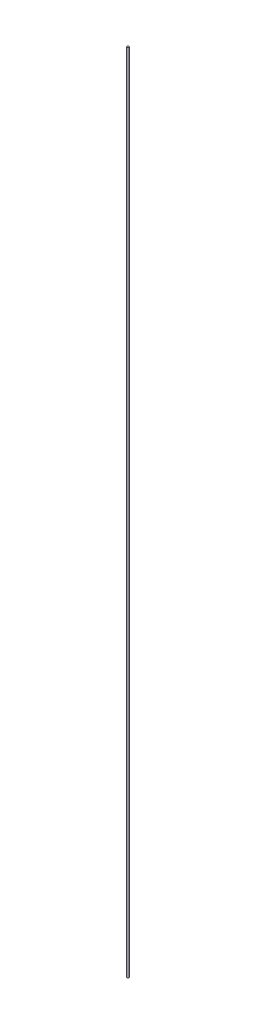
ISO-10303-21;
HEADER;
FILE_DESCRIPTION(('STEP AP214'),'2;1');
FILE_NAME('part.step','',(''),(''),'','','');
FILE_SCHEMA(('AUTOMOTIVE_DESIGN { 1 0 10303 214 1 1 1 1 }'));
ENDSEC;
DATA;
#1=APPLICATION_CONTEXT('core data for automotive mechanical design processes');
#2=APPLICATION_PROTOCOL_DEFINITION('international standard','automotive_design',2000,#1);
#3=PRODUCT_CONTEXT('',#1,'mechanical');
#4=PRODUCT('Part','Part','',(#3));
#5=PRODUCT_RELATED_PRODUCT_CATEGORY('part','',(#4));
#6=PRODUCT_DEFINITION_FORMATION('','',#4);
#7=PRODUCT_DEFINITION_CONTEXT('part definition',#1,'design');
#8=PRODUCT_DEFINITION('design','',#6,#7);
#9=PRODUCT_DEFINITION_SHAPE('','',#8);
#10=(LENGTH_UNIT() NAMED_UNIT(*) SI_UNIT(.MILLI.,.METRE.));
#11=(NAMED_UNIT(*) PLANE_ANGLE_UNIT() SI_UNIT($,.RADIAN.));
#12=(NAMED_UNIT(*) SI_UNIT($,.STERADIAN.) SOLID_ANGLE_UNIT());
#13=UNCERTAINTY_MEASURE_WITH_UNIT(LENGTH_MEASURE(1.E-05),#10,'distance_accuracy_value','');
#14=(GEOMETRIC_REPRESENTATION_CONTEXT(3) GLOBAL_UNCERTAINTY_ASSIGNED_CONTEXT((#13)) GLOBAL_UNIT_ASSIGNED_CONTEXT((#10,
#11,#12)) REPRESENTATION_CONTEXT('',''));
#15=CARTESIAN_POINT('',(0.,0.,0.));
#16=DIRECTION('',(0.,0.,1.));
#17=DIRECTION('',(1.,0.,0.));
#18=AXIS2_PLACEMENT_3D('',#15,#16,#17);
#19=CARTESIAN_POINT('',(0.,2000.,0.));
#20=DIRECTION('',(0.,-1.,0.));
#21=DIRECTION('',(0.,0.,-1.));
#22=AXIS2_PLACEMENT_3D('',#19,#20,#21);
#23=CYLINDRICAL_SURFACE('',#22,2.5);
#24=CARTESIAN_POINT('',(0.,2000.,0.));
#25=DIRECTION('',(0.,1.,0.));
#26=DIRECTION('',(0.,0.,1.));
#27=AXIS2_PLACEMENT_3D('',#24,#25,#26);
#28=CIRCLE('',#27,2.5);
#29=CARTESIAN_POINT('',(0.,2000.,2.5));
#30=VERTEX_POINT('',#29);
#31=EDGE_CURVE('E10',#30,#30,#28,.T.);
#32=ORIENTED_EDGE('',*,*,#31,.F.);
#33=EDGE_LOOP('',(#32));
#34=FACE_BOUND('',#33,.T.);
#35=CARTESIAN_POINT('',(0.,0.,0.));
#36=DIRECTION('',(0.,1.,0.));
#37=DIRECTION('',(0.,0.,1.));
#38=AXIS2_PLACEMENT_3D('',#35,#36,#37);
#39=CIRCLE('',#38,2.5);
#40=CARTESIAN_POINT('',(0.,0.,2.5));
#41=VERTEX_POINT('',#40);
#42=EDGE_CURVE('E33',#41,#41,#39,.T.);
#43=ORIENTED_EDGE('',*,*,#42,.T.);
#44=EDGE_LOOP('',(#43));
#45=FACE_BOUND('',#44,.T.);
#46=ADVANCED_FACE('F30',(#34,#45),#23,.T.);
#47=CARTESIAN_POINT('',(0.,2000.,0.));
#48=DIRECTION('',(0.,1.,0.));
#49=DIRECTION('',(0.,0.,1.));
#50=AXIS2_PLACEMENT_3D('',#47,#48,#49);
#51=PLANE('',#50);
#52=ORIENTED_EDGE('',*,*,#31,.T.);
#53=EDGE_LOOP('',(#52));
#54=FACE_BOUND('',#53,.T.);
#55=ADVANCED_FACE('F45',(#54),#51,.T.);
#56=CARTESIAN_POINT('',(0.,0.,0.));
#57=DIRECTION('',(0.,1.,0.));
#58=DIRECTION('',(0.,0.,1.));
#59=AXIS2_PLACEMENT_3D('',#56,#57,#58);
#60=PLANE('',#59);
#61=ORIENTED_EDGE('',*,*,#42,.F.);
#62=EDGE_LOOP('',(#61));
#63=FACE_BOUND('',#62,.T.);
#64=ADVANCED_FACE('F43',(#63),#60,.F.);
#65=CLOSED_SHELL('',(#46,#55,#64));
#66=MANIFOLD_SOLID_BREP('B2',#65);
#67=ADVANCED_BREP_SHAPE_REPRESENTATION('',(#18,#66),#14);
#68=SHAPE_DEFINITION_REPRESENTATION(#9,#67);
ENDSEC;
END-ISO-10303-21;
